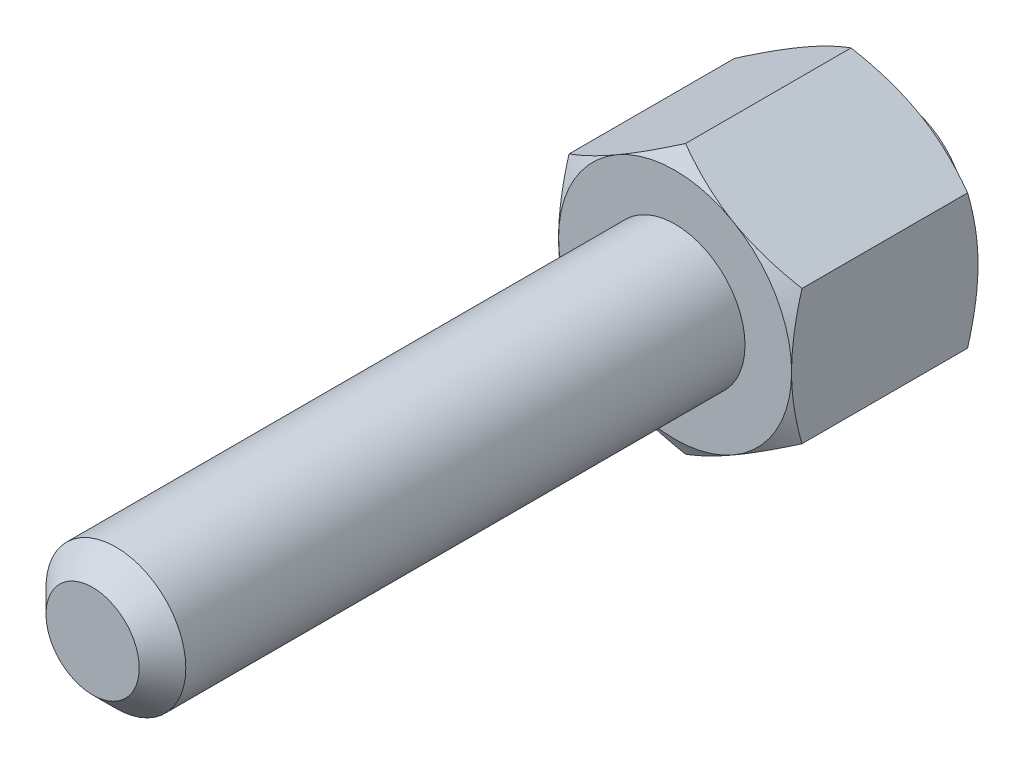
ISO-10303-21;
HEADER;
FILE_DESCRIPTION(('STEP AP214'),'2;1');
FILE_NAME('part.step','',(''),(''),'','','');
FILE_SCHEMA(('AUTOMOTIVE_DESIGN { 1 0 10303 214 1 1 1 1 }'));
ENDSEC;
DATA;
#1=APPLICATION_CONTEXT('core data for automotive mechanical design processes');
#2=APPLICATION_PROTOCOL_DEFINITION('international standard','automotive_design',2000,#1);
#3=PRODUCT_CONTEXT('',#1,'mechanical');
#4=PRODUCT('Part','Part','',(#3));
#5=PRODUCT_RELATED_PRODUCT_CATEGORY('part','',(#4));
#6=PRODUCT_DEFINITION_FORMATION('','',#4);
#7=PRODUCT_DEFINITION_CONTEXT('part definition',#1,'design');
#8=PRODUCT_DEFINITION('design','',#6,#7);
#9=PRODUCT_DEFINITION_SHAPE('','',#8);
#10=(LENGTH_UNIT() NAMED_UNIT(*) SI_UNIT(.MILLI.,.METRE.));
#11=(NAMED_UNIT(*) PLANE_ANGLE_UNIT() SI_UNIT($,.RADIAN.));
#12=(NAMED_UNIT(*) SI_UNIT($,.STERADIAN.) SOLID_ANGLE_UNIT());
#13=UNCERTAINTY_MEASURE_WITH_UNIT(LENGTH_MEASURE(1.E-05),#10,'distance_accuracy_value','');
#14=(GEOMETRIC_REPRESENTATION_CONTEXT(3) GLOBAL_UNCERTAINTY_ASSIGNED_CONTEXT((#13)) GLOBAL_UNIT_ASSIGNED_CONTEXT((#10,
#11,#12)) REPRESENTATION_CONTEXT('',''));
#15=CARTESIAN_POINT('',(0.,0.,0.));
#16=DIRECTION('',(0.,0.,1.));
#17=DIRECTION('',(1.,0.,0.));
#18=AXIS2_PLACEMENT_3D('',#15,#16,#17);
#19=CARTESIAN_POINT('',(0.,-5.77350269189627,11.5));
#20=DIRECTION('',(-0.500000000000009,0.866025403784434,0.));
#21=DIRECTION('',(0.866025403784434,0.500000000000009,0.));
#22=AXIS2_PLACEMENT_3D('',#19,#20,#21);
#23=PLANE('',#22);
#24=CARTESIAN_POINT('',(5.0002,-2.88663587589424,1.94664865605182));
#25=CARTESIAN_POINT('',(4.78046540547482,-3.01349970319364,1.87338656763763));
#26=CARTESIAN_POINT('',(4.55885141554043,-3.14144859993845,1.80675132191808));
#27=CARTESIAN_POINT('',(4.1117860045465,-3.39956193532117,1.6904389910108));
#28=CARTESIAN_POINT('',(3.88632664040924,-3.52973095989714,1.64080304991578));
#29=CARTESIAN_POINT('',(3.43816769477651,-3.78847564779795,1.56355102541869));
#30=CARTESIAN_POINT('',(3.21553790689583,-3.91701101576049,1.53542037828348));
#31=CARTESIAN_POINT('',(2.88081009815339,-4.1102662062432,1.51019492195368));
#32=CARTESIAN_POINT('',(2.76915780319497,-4.17472868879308,1.50461345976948));
#33=CARTESIAN_POINT('',(2.54575002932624,-4.30371322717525,1.49920221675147));
#34=CARTESIAN_POINT('',(2.43399455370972,-4.36823528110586,1.4993722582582));
#35=CARTESIAN_POINT('',(2.12781576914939,-4.54500768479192,1.50775363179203));
#36=CARTESIAN_POINT('',(1.93349391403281,-4.65719946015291,1.52182977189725));
#37=CARTESIAN_POINT('',(1.54613989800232,-4.88083840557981,1.56646525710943));
#38=CARTESIAN_POINT('',(1.35310909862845,-4.9922847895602,1.59703986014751));
#39=CARTESIAN_POINT('',(0.964974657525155,-5.21637431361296,1.67346849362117));
#40=CARTESIAN_POINT('',(0.76992000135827,-5.3289891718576,1.71964637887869));
#41=CARTESIAN_POINT('',(0.38271965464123,-5.55253939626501,1.82445179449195));
#42=CARTESIAN_POINT('',(0.190569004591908,-5.66347762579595,1.88305470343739));
#43=CARTESIAN_POINT('',(-0.000200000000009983,-5.77361816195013,1.94664865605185));
#44=B_SPLINE_CURVE_WITH_KNOTS('',3,(#24,#25,#26,#27,#28,#29,#30,#31,#32,#33,#34,#35,#36,#37,#38,
#39,#40,#41,#42,#43),.UNSPECIFIED.,.F.,.F.,(4,2,2,2,2,2,2,2,2,4),(0.,0.792555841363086,
1.58701660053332,2.36181537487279,2.74884076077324,3.13585419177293,3.80962362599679,
4.48401723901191,5.17336882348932,5.8613669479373),.UNSPECIFIED.);
#45=CARTESIAN_POINT('',(5.,-2.88675134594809,1.94658198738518));
#46=VERTEX_POINT('',#45);
#47=CARTESIAN_POINT('',(2.5,-4.3301270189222,1.5));
#48=VERTEX_POINT('',#47);
#49=EDGE_CURVE('E137',#46,#48,#44,.T.);
#50=ORIENTED_EDGE('',*,*,#49,.F.);
#51=DIRECTION('',(0.,0.,-1.));
#52=VECTOR('',#51,1.);
#53=CARTESIAN_POINT('',(5.,-2.88675134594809,11.5));
#54=LINE('',#53,#52);
#55=CARTESIAN_POINT('',(5.,-2.88675134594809,9.05341801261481));
#56=VERTEX_POINT('',#55);
#57=EDGE_CURVE('E299',#56,#46,#54,.T.);
#58=ORIENTED_EDGE('',*,*,#57,.F.);
#59=CARTESIAN_POINT('',(-0.00019999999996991,-5.77361816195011,9.05335134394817));
#60=CARTESIAN_POINT('',(0.219534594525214,-5.64675433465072,9.12661343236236));
#61=CARTESIAN_POINT('',(0.441148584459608,-5.5188054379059,9.1932486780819));
#62=CARTESIAN_POINT('',(0.888213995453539,-5.26069210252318,9.30956100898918));
#63=CARTESIAN_POINT('',(1.1136733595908,-5.13052307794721,9.35919695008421));
#64=CARTESIAN_POINT('',(1.56183230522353,-4.8717783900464,9.4364489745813));
#65=CARTESIAN_POINT('',(1.78446209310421,-4.74324302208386,9.46457962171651));
#66=CARTESIAN_POINT('',(2.11918990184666,-4.54998783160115,9.48980507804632));
#67=CARTESIAN_POINT('',(2.23084219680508,-4.48552534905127,9.49538654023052));
#68=CARTESIAN_POINT('',(2.45424997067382,-4.35654081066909,9.50079778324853));
#69=CARTESIAN_POINT('',(2.56600544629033,-4.29201875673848,9.5006277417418));
#70=CARTESIAN_POINT('',(2.87218423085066,-4.11524635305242,9.49224636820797));
#71=CARTESIAN_POINT('',(3.06650608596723,-4.00305457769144,9.47817022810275));
#72=CARTESIAN_POINT('',(3.45386010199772,-3.77941563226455,9.43353474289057));
#73=CARTESIAN_POINT('',(3.64689090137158,-3.66796924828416,9.4029601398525));
#74=CARTESIAN_POINT('',(4.03502534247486,-3.44387972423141,9.32653150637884));
#75=CARTESIAN_POINT('',(4.23007999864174,-3.33126486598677,9.28035362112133));
#76=CARTESIAN_POINT('',(4.61728034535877,-3.10771464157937,9.17554820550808));
#77=CARTESIAN_POINT('',(4.80943099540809,-2.99677641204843,9.11694529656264));
#78=CARTESIAN_POINT('',(5.0002,-2.88663587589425,9.05335134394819));
#79=B_SPLINE_CURVE_WITH_KNOTS('',3,(#59,#60,#61,#62,#63,#64,#65,#66,#67,#68,#69,#70,#71,#72,#73,
#74,#75,#76,#77,#78),.UNSPECIFIED.,.F.,.F.,(4,2,2,2,2,2,2,2,2,4),(0.,0.792555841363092,
1.58701660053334,2.36181537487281,2.74884076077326,3.13585419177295,3.8096236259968,
4.48401723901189,5.17336882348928,5.86136694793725),.UNSPECIFIED.);
#80=CARTESIAN_POINT('',(2.50000000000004,-4.33012701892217,9.5));
#81=VERTEX_POINT('',#80);
#82=EDGE_CURVE('E213',#81,#56,#79,.T.);
#83=ORIENTED_EDGE('',*,*,#82,.F.);
#84=CARTESIAN_POINT('',(0.,-5.77350269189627,9.0534180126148));
#85=VERTEX_POINT('',#84);
#86=EDGE_CURVE('E259',#85,#81,#79,.T.);
#87=ORIENTED_EDGE('',*,*,#86,.F.);
#88=DIRECTION('',(0.,0.,-1.));
#89=VECTOR('',#88,1.);
#90=CARTESIAN_POINT('',(0.,-5.77350269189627,11.5));
#91=LINE('',#90,#89);
#92=CARTESIAN_POINT('',(0.,-5.77350269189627,1.94658198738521));
#93=VERTEX_POINT('',#92);
#94=EDGE_CURVE('E294',#85,#93,#91,.T.);
#95=ORIENTED_EDGE('',*,*,#94,.T.);
#96=EDGE_CURVE('E37',#48,#93,#44,.T.);
#97=ORIENTED_EDGE('',*,*,#96,.F.);
#98=EDGE_LOOP('',(#50,#58,#83,#87,#95,#97));
#99=FACE_BOUND('',#98,.T.);
#100=ADVANCED_FACE('F14',(#99),#23,.F.);
#101=CARTESIAN_POINT('',(5.,-2.88675134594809,11.5));
#102=DIRECTION('',(-1.,0.,0.));
#103=DIRECTION('',(0.,0.,-1.));
#104=AXIS2_PLACEMENT_3D('',#101,#102,#103);
#105=PLANE('',#104);
#106=CARTESIAN_POINT('',(5.,-7.70744127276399,3.91748127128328));
#107=CARTESIAN_POINT('',(5.,-7.48944850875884,3.8119239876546));
#108=CARTESIAN_POINT('',(5.,-7.27095027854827,3.70739243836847));
#109=CARTESIAN_POINT('',(5.,-6.83267390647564,3.50095865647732));
#110=CARTESIAN_POINT('',(5.,-6.61289556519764,3.39905684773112));
#111=CARTESIAN_POINT('',(5.,-6.17063500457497,3.19793766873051));
#112=CARTESIAN_POINT('',(5.,-5.94814454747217,3.09873834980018));
#113=CARTESIAN_POINT('',(5.,-5.50137759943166,2.90446216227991));
#114=CARTESIAN_POINT('',(5.,-5.27710119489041,2.80938509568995));
#115=CARTESIAN_POINT('',(5.,-4.81934362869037,2.62154541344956));
#116=CARTESIAN_POINT('',(5.,-4.58579411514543,2.52894844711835));
#117=CARTESIAN_POINT('',(5.,-4.11594543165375,2.35087648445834));
#118=CARTESIAN_POINT('',(5.,-3.87964595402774,2.26540229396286));
#119=CARTESIAN_POINT('',(5.,-3.40437913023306,2.10385408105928));
#120=CARTESIAN_POINT('',(5.,-3.16541846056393,2.02776061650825));
#121=CARTESIAN_POINT('',(5.,-2.68406991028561,1.88744643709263));
#122=CARTESIAN_POINT('',(5.,-2.44168315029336,1.82322193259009));
#123=CARTESIAN_POINT('',(5.,-1.95468423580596,1.7100982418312));
#124=CARTESIAN_POINT('',(5.,-1.71009137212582,1.66111755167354));
#125=CARTESIAN_POINT('',(5.,-1.2179134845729,1.58128125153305));
#126=CARTESIAN_POINT('',(5.,-0.970328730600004,1.5504240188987));
#127=CARTESIAN_POINT('',(5.,-0.476617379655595,1.50970112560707));
#128=CARTESIAN_POINT('',(5.,-0.230513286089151,1.49956934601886));
#129=CARTESIAN_POINT('',(5.,0.26167501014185,1.50045868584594));
#130=CARTESIAN_POINT('',(5.,0.507759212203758,1.51148030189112));
#131=CARTESIAN_POINT('',(5.,0.926943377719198,1.54749890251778));
#132=CARTESIAN_POINT('',(5.,1.10049654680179,1.56751128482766));
#133=CARTESIAN_POINT('',(5.,1.44629389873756,1.61678599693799));
#134=CARTESIAN_POINT('',(5.,1.61853789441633,1.64604962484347));
#135=CARTESIAN_POINT('',(5.,2.13309893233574,1.74617515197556));
#136=CARTESIAN_POINT('',(5.,2.47304427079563,1.82935219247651));
#137=CARTESIAN_POINT('',(5.,2.98128183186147,1.97308911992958));
#138=CARTESIAN_POINT('',(5.,3.15222109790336,2.02481822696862));
#139=CARTESIAN_POINT('',(5.,3.49243829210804,2.1335258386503));
#140=CARTESIAN_POINT('',(5.,3.66171620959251,2.19050437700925));
#141=CARTESIAN_POINT('',(5.,3.99866665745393,2.30880682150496));
#142=CARTESIAN_POINT('',(5.,4.16633972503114,2.37012921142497));
#143=CARTESIAN_POINT('',(5.,4.50030514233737,2.4964102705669));
#144=CARTESIAN_POINT('',(5.,4.66659750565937,2.56136890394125));
#145=CARTESIAN_POINT('',(5.,5.04803367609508,2.71440889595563));
#146=CARTESIAN_POINT('',(5.,5.26275324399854,2.80354544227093));
#147=CARTESIAN_POINT('',(5.,5.69045278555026,2.9859093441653));
#148=CARTESIAN_POINT('',(5.,5.90343266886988,3.07913691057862));
#149=CARTESIAN_POINT('',(5.,6.32795935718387,3.26889080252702));
#150=CARTESIAN_POINT('',(5.,6.53950590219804,3.36541770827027));
#151=CARTESIAN_POINT('',(5.,6.96136313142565,3.56113912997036));
#152=CARTESIAN_POINT('',(5.,7.17167379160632,3.66033369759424));
#153=CARTESIAN_POINT('',(5.,7.80142682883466,3.96134775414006));
#154=CARTESIAN_POINT('',(5.,8.21931083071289,4.16642577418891));
#155=CARTESIAN_POINT('',(5.,9.05210217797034,4.5825381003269));
#156=CARTESIAN_POINT('',(5.,9.46700942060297,4.79357261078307));
#157=CARTESIAN_POINT('',(5.,10.0712479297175,5.10485123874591));
#158=CARTESIAN_POINT('',(5.,10.2614503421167,5.20340928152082));
#159=CARTESIAN_POINT('',(5.,10.6414400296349,5.40131443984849));
#160=CARTESIAN_POINT('',(5.,10.8312273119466,5.50066154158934));
#161=CARTESIAN_POINT('',(5.,11.4000634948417,5.799737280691));
#162=CARTESIAN_POINT('',(5.,11.7785724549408,6.00049297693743));
#163=CARTESIAN_POINT('',(5.,12.5336033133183,6.40364018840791));
#164=CARTESIAN_POINT('',(5.,12.9101277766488,6.6060269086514));
#165=CARTESIAN_POINT('',(5.,13.6622573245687,7.01245675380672));
#166=CARTESIAN_POINT('',(5.,14.0378624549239,7.21649979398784));
#167=CARTESIAN_POINT('',(5.,14.4131258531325,7.42116548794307));
#168=B_SPLINE_CURVE_WITH_KNOTS('',3,(#106,#107,#108,#109,#110,#111,#112,#113,#114,#115,#116,
#117,#118,#119,#120,#121,#122,#123,#124,#125,#126,#127,#128,#129,#130,#131,#132,#133,#134,#135,
#136,#137,#138,#139,#140,#141,#142,#143,#144,#145,#146,#147,#148,#149,#150,#151,#152,#153,#154,
#155,#156,#157,#158,#159,#160,#161,#162,#163,#164,#165,#166,#167),.UNSPECIFIED.,.F.,.F.,(4,2,2,
2,2,2,2,2,2,2,2,2,2,2,2,2,2,2,2,2,2,2,2,2,2,2,2,2,2,2,4),(0.,0.726623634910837,1.45336366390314,
2.18413973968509,2.91488067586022,3.66849919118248,4.42220285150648,5.17431717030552,
5.92619093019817,6.67397270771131,7.42168752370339,8.15973969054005,8.89780918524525,
9.42166361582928,9.9455915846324,10.9940498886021,11.5297908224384,12.0655351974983,
12.6010934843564,13.1366464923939,13.8340490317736,14.5314875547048,15.229049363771,
15.9266246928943,17.3230246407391,18.7194725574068,19.3621341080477,20.0047844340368,
21.2901332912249,22.5725406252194,23.8548827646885),.UNSPECIFIED.);
#169=CARTESIAN_POINT('',(5.,2.88675134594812,1.94658198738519));
#170=VERTEX_POINT('',#169);
#171=CARTESIAN_POINT('',(5.,0.,1.5));
#172=VERTEX_POINT('',#171);
#173=EDGE_CURVE('E390',#170,#172,#168,.F.);
#174=ORIENTED_EDGE('',*,*,#173,.F.);
#175=DIRECTION('',(0.,0.,-1.));
#176=VECTOR('',#175,1.);
#177=CARTESIAN_POINT('',(5.,2.88675134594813,11.5));
#178=LINE('',#177,#176);
#179=CARTESIAN_POINT('',(5.,2.88675134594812,9.05341801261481));
#180=VERTEX_POINT('',#179);
#181=EDGE_CURVE('E291',#180,#170,#178,.T.);
#182=ORIENTED_EDGE('',*,*,#181,.F.);
#183=CARTESIAN_POINT('',(5.,-7.74883329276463,7.06245429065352));
#184=CARTESIAN_POINT('',(5.,-7.53049946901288,7.16834431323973));
#185=CARTESIAN_POINT('',(5.,-7.31166387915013,7.27321749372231));
#186=CARTESIAN_POINT('',(5.,-6.8727223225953,7.4803581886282));
#187=CARTESIAN_POINT('',(5.,-6.65261616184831,7.58262529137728));
#188=CARTESIAN_POINT('',(5.,-6.20972996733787,7.78449751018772));
#189=CARTESIAN_POINT('',(5.,-5.98694189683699,7.88408505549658));
#190=CARTESIAN_POINT('',(5.,-5.53959195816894,8.07917770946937));
#191=CARTESIAN_POINT('',(5.,-5.31503017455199,8.17468301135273));
#192=CARTESIAN_POINT('',(5.,-4.85653860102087,8.36351388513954));
#193=CARTESIAN_POINT('',(5.,-4.62253924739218,8.45667147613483));
#194=CARTESIAN_POINT('',(5.,-4.15180084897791,8.63592319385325));
#195=CARTESIAN_POINT('',(5.,-3.9150614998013,8.72201652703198));
#196=CARTESIAN_POINT('',(5.,-3.43891142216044,8.88487567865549));
#197=CARTESIAN_POINT('',(5.,-3.19950723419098,8.96166042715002));
#198=CARTESIAN_POINT('',(5.,-2.71726462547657,9.1034348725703));
#199=CARTESIAN_POINT('',(5.,-2.47442731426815,9.16842829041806));
#200=CARTESIAN_POINT('',(5.,-1.98653288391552,9.28315054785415));
#201=CARTESIAN_POINT('',(5.,-1.74149561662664,9.33296225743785));
#202=CARTESIAN_POINT('',(5.,-1.24837916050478,9.41450383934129));
#203=CARTESIAN_POINT('',(5.,-1.00030025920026,9.44623540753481));
#204=CARTESIAN_POINT('',(5.,-0.505577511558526,9.48866997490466));
#205=CARTESIAN_POINT('',(5.,-0.25895739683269,9.49964283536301));
#206=CARTESIAN_POINT('',(5.,0.234332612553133,9.50033965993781));
#207=CARTESIAN_POINT('',(5.,0.481002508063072,9.49006322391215));
#208=CARTESIAN_POINT('',(5.,0.899937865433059,9.45529080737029));
#209=CARTESIAN_POINT('',(5.,1.07265207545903,9.43589361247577));
#210=CARTESIAN_POINT('',(5.,1.41680507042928,9.3878920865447));
#211=CARTESIAN_POINT('',(5.,1.58824367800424,9.35928649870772));
#212=CARTESIAN_POINT('',(5.,2.10042470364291,9.26116179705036));
#213=CARTESIAN_POINT('',(5.,2.43883828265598,9.17935298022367));
#214=CARTESIAN_POINT('',(5.,2.94483676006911,9.03763933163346));
#215=CARTESIAN_POINT('',(5.,3.11504848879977,8.98658079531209));
#216=CARTESIAN_POINT('',(5.,3.45381823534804,8.87919651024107));
#217=CARTESIAN_POINT('',(5.,3.62237624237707,8.8228707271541));
#218=CARTESIAN_POINT('',(5.,3.95789251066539,8.70585282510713));
#219=CARTESIAN_POINT('',(5.,4.12485128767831,8.64516217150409));
#220=CARTESIAN_POINT('',(5.,4.45738812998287,8.52012492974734));
#221=CARTESIAN_POINT('',(5.,4.62296621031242,8.45577838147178));
#222=CARTESIAN_POINT('',(5.,5.00898021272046,8.30164185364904));
#223=CARTESIAN_POINT('',(5.,5.22893065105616,8.21063840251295));
#224=CARTESIAN_POINT('',(5.,5.66699461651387,8.02430103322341));
#225=CARTESIAN_POINT('',(5.,5.88510803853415,7.92896686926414));
#226=CARTESIAN_POINT('',(5.,6.31982994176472,7.73482468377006));
#227=CARTESIAN_POINT('',(5.,6.53643812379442,7.63601599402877));
#228=CARTESIAN_POINT('',(5.,6.96835984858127,7.43560426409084));
#229=CARTESIAN_POINT('',(5.,7.18367336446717,7.33400116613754));
#230=CARTESIAN_POINT('',(5.,7.82840184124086,7.02560744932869));
#231=CARTESIAN_POINT('',(5.,8.25619086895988,6.81541977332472));
#232=CARTESIAN_POINT('',(5.,9.10868695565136,6.3888855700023));
#233=CARTESIAN_POINT('',(5.,9.53339390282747,6.17253882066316));
#234=CARTESIAN_POINT('',(5.,10.1513439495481,5.85370074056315));
#235=CARTESIAN_POINT('',(5.,10.3454851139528,5.75294487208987));
#236=CARTESIAN_POINT('',(5.,10.7333432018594,5.55062830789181));
#237=CARTESIAN_POINT('',(5.,10.9270601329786,5.44906762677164));
#238=CARTESIAN_POINT('',(5.,11.5076762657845,5.14333198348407));
#239=CARTESIAN_POINT('',(5.,11.8940250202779,4.93811158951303));
#240=CARTESIAN_POINT('',(5.,12.6646488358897,4.52604252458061));
#241=CARTESIAN_POINT('',(5.,13.048926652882,4.3191989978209));
#242=CARTESIAN_POINT('',(5.,13.8165498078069,3.90383718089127));
#243=CARTESIAN_POINT('',(5.,14.199895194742,3.6953189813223));
#244=CARTESIAN_POINT('',(5.,14.5828959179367,3.48617358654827));
#245=B_SPLINE_CURVE_WITH_KNOTS('',3,(#183,#184,#185,#186,#187,#188,#189,#190,#191,#192,#193,
#194,#195,#196,#197,#198,#199,#200,#201,#202,#203,#204,#205,#206,#207,#208,#209,#210,#211,#212,
#213,#214,#215,#216,#217,#218,#219,#220,#221,#222,#223,#224,#225,#226,#227,#228,#229,#230,#231,
#232,#233,#234,#235,#236,#237,#238,#239,#240,#241,#242,#243,#244),.UNSPECIFIED.,.F.,.F.,(4,2,2,
2,2,2,2,2,2,2,2,2,2,2,2,2,2,2,2,2,2,2,2,2,2,2,2,2,2,2,4),(0.,0.727979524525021,1.45607334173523,
2.18814015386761,2.92017227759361,3.67566755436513,4.43124758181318,5.18526431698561,
5.93904269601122,6.68862964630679,7.43814627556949,8.17785045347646,8.91756856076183,
9.4387156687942,9.95993393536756,11.002952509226,11.5360222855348,12.0690955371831,
12.6019906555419,13.1348799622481,13.8489176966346,14.5629960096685,15.2772124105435,
15.9914435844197,17.4212685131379,18.8511450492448,19.5073316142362,20.1635062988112,
21.475908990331,22.7851347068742,24.0942900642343),.UNSPECIFIED.);
#246=CARTESIAN_POINT('',(5.,0.,9.5));
#247=VERTEX_POINT('',#246);
#248=EDGE_CURVE('E222',#247,#180,#245,.T.);
#249=ORIENTED_EDGE('',*,*,#248,.F.);
#250=EDGE_CURVE('E340',#56,#247,#245,.T.);
#251=ORIENTED_EDGE('',*,*,#250,.F.);
#252=ORIENTED_EDGE('',*,*,#57,.T.);
#253=EDGE_CURVE('E188',#172,#46,#168,.F.);
#254=ORIENTED_EDGE('',*,*,#253,.F.);
#255=EDGE_LOOP('',(#174,#182,#249,#251,#252,#254));
#256=FACE_BOUND('',#255,.T.);
#257=ADVANCED_FACE('F198',(#256),#105,.F.);
#258=CARTESIAN_POINT('',(0.,5.77350269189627,11.5));
#259=DIRECTION('',(0.5,0.866025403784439,0.));
#260=DIRECTION('',(0.866025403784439,-0.5,0.));
#261=AXIS2_PLACEMENT_3D('',#258,#259,#260);
#262=PLANE('',#261);
#263=ORIENTED_EDGE('',*,*,#181,.T.);
#264=CARTESIAN_POINT('',(5.0002,2.88663587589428,1.94664865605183));
#265=CARTESIAN_POINT('',(4.78046540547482,3.01349970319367,1.87338656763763));
#266=CARTESIAN_POINT('',(4.55885141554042,3.14144859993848,1.80675132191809));
#267=CARTESIAN_POINT('',(4.11178600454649,3.3995619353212,1.69043899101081));
#268=CARTESIAN_POINT('',(3.88632664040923,3.52973095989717,1.64080304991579));
#269=CARTESIAN_POINT('',(3.43816769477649,3.78847564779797,1.5635510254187));
#270=CARTESIAN_POINT('',(3.21553790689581,3.91701101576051,1.53542037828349));
#271=CARTESIAN_POINT('',(2.88081009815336,4.11026620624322,1.51019492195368));
#272=CARTESIAN_POINT('',(2.76915780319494,4.1747286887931,1.50461345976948));
#273=CARTESIAN_POINT('',(2.54575002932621,4.30371322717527,1.49920221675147));
#274=CARTESIAN_POINT('',(2.43399455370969,4.36823528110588,1.4993722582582));
#275=CARTESIAN_POINT('',(2.12781576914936,4.54500768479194,1.50775363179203));
#276=CARTESIAN_POINT('',(1.93349391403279,4.65719946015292,1.52182977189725));
#277=CARTESIAN_POINT('',(1.54613989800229,4.88083840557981,1.56646525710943));
#278=CARTESIAN_POINT('',(1.35310909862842,4.9922847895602,1.59703986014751));
#279=CARTESIAN_POINT('',(0.96497465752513,5.21637431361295,1.67346849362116));
#280=CARTESIAN_POINT('',(0.769920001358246,5.32898917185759,1.71964637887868));
#281=CARTESIAN_POINT('',(0.382719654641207,5.55253939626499,1.82445179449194));
#282=CARTESIAN_POINT('',(0.190569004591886,5.66347762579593,1.88305470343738));
#283=CARTESIAN_POINT('',(-0.000200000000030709,5.77361816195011,1.94664865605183));
#284=B_SPLINE_CURVE_WITH_KNOTS('',3,(#264,#265,#266,#267,#268,#269,#270,#271,#272,#273,#274,
#275,#276,#277,#278,#279,#280,#281,#282,#283),.UNSPECIFIED.,.F.,.F.,(4,2,2,2,2,2,2,2,2,4),(0.,
0.792555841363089,1.58701660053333,2.3618153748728,2.74884076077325,3.13585419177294,
3.8096236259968,4.48401723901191,5.17336882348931,5.86136694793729),.UNSPECIFIED.);
#285=CARTESIAN_POINT('',(2.5,4.33012701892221,1.5));
#286=VERTEX_POINT('',#285);
#287=EDGE_CURVE('E138',#170,#286,#284,.T.);
#288=ORIENTED_EDGE('',*,*,#287,.T.);
#289=CARTESIAN_POINT('',(0.,5.77350269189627,1.94658198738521));
#290=VERTEX_POINT('',#289);
#291=EDGE_CURVE('E118',#286,#290,#284,.T.);
#292=ORIENTED_EDGE('',*,*,#291,.T.);
#293=DIRECTION('',(0.,0.,-1.));
#294=VECTOR('',#293,1.);
#295=CARTESIAN_POINT('',(0.,5.77350269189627,11.5));
#296=LINE('',#295,#294);
#297=CARTESIAN_POINT('',(0.,5.77350269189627,9.0534180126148));
#298=VERTEX_POINT('',#297);
#299=EDGE_CURVE('E136',#298,#290,#296,.T.);
#300=ORIENTED_EDGE('',*,*,#299,.F.);
#301=CARTESIAN_POINT('',(-0.000200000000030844,5.77361816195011,9.05335134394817));
#302=CARTESIAN_POINT('',(0.219534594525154,5.64675433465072,9.12661343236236));
#303=CARTESIAN_POINT('',(0.44114858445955,5.51880543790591,9.1932486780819));
#304=CARTESIAN_POINT('',(0.888213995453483,5.26069210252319,9.30956100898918));
#305=CARTESIAN_POINT('',(1.11367335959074,5.13052307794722,9.35919695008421));
#306=CARTESIAN_POINT('',(1.56183230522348,4.87177839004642,9.4364489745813));
#307=CARTESIAN_POINT('',(1.78446209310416,4.74324302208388,9.46457962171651));
#308=CARTESIAN_POINT('',(2.11918990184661,4.54998783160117,9.48980507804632));
#309=CARTESIAN_POINT('',(2.23084219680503,4.48552534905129,9.49538654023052));
#310=CARTESIAN_POINT('',(2.45424997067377,4.35654081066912,9.50079778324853));
#311=CARTESIAN_POINT('',(2.56600544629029,4.29201875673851,9.5006277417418));
#312=CARTESIAN_POINT('',(2.87218423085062,4.11524635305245,9.49224636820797));
#313=CARTESIAN_POINT('',(3.06650608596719,4.00305457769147,9.47817022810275));
#314=CARTESIAN_POINT('',(3.45386010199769,3.77941563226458,9.43353474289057));
#315=CARTESIAN_POINT('',(3.64689090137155,3.66796924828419,9.4029601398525));
#316=CARTESIAN_POINT('',(4.03502534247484,3.44387972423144,9.32653150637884));
#317=CARTESIAN_POINT('',(4.23007999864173,3.3312648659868,9.28035362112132));
#318=CARTESIAN_POINT('',(4.61728034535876,3.1077146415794,9.17554820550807));
#319=CARTESIAN_POINT('',(4.80943099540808,2.99677641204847,9.11694529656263));
#320=CARTESIAN_POINT('',(5.0002,2.88663587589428,9.05335134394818));
#321=B_SPLINE_CURVE_WITH_KNOTS('',3,(#301,#302,#303,#304,#305,#306,#307,#308,#309,#310,#311,
#312,#313,#314,#315,#316,#317,#318,#319,#320),.UNSPECIFIED.,.F.,.F.,(4,2,2,2,2,2,2,2,2,4),(0.,
0.792555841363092,1.58701660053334,2.36181537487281,2.74884076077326,3.13585419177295,
3.8096236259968,4.48401723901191,5.17336882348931,5.86136694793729),.UNSPECIFIED.);
#322=CARTESIAN_POINT('',(2.5,4.33012701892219,9.5));
#323=VERTEX_POINT('',#322);
#324=EDGE_CURVE('E204',#298,#323,#321,.T.);
#325=ORIENTED_EDGE('',*,*,#324,.T.);
#326=EDGE_CURVE('E215',#323,#180,#321,.T.);
#327=ORIENTED_EDGE('',*,*,#326,.T.);
#328=EDGE_LOOP('',(#263,#288,#292,#300,#325,#327));
#329=FACE_BOUND('',#328,.T.);
#330=ADVANCED_FACE('F195',(#329),#262,.T.);
#331=CARTESIAN_POINT('',(0.,5.77350269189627,11.5));
#332=DIRECTION('',(0.500000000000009,-0.866025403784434,0.));
#333=DIRECTION('',(-0.866025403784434,-0.500000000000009,0.));
#334=AXIS2_PLACEMENT_3D('',#331,#332,#333);
#335=PLANE('',#334);
#336=CARTESIAN_POINT('',(-5.0002,2.88663587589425,1.94664865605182));
#337=CARTESIAN_POINT('',(-4.78046540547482,3.01349970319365,1.87338656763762));
#338=CARTESIAN_POINT('',(-4.55885141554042,3.14144859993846,1.80675132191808));
#339=CARTESIAN_POINT('',(-4.11178600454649,3.39956193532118,1.6904389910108));
#340=CARTESIAN_POINT('',(-3.88632664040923,3.52973095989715,1.64080304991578));
#341=CARTESIAN_POINT('',(-3.4381676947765,3.78847564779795,1.56355102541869));
#342=CARTESIAN_POINT('',(-3.21553790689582,3.9170110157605,1.53542037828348));
#343=CARTESIAN_POINT('',(-2.88081009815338,4.1102662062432,1.51019492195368));
#344=CARTESIAN_POINT('',(-2.76915780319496,4.17472868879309,1.50461345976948));
#345=CARTESIAN_POINT('',(-2.54575002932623,4.30371322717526,1.49920221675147));
#346=CARTESIAN_POINT('',(-2.43399455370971,4.36823528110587,1.4993722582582));
#347=CARTESIAN_POINT('',(-2.12781576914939,4.54500768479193,1.50775363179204));
#348=CARTESIAN_POINT('',(-1.93349391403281,4.65719946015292,1.52182977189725));
#349=CARTESIAN_POINT('',(-1.54613989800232,4.88083840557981,1.56646525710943));
#350=CARTESIAN_POINT('',(-1.35310909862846,4.9922847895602,1.59703986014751));
#351=CARTESIAN_POINT('',(-0.964974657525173,5.21637431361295,1.67346849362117));
#352=CARTESIAN_POINT('',(-0.769920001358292,5.32898917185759,1.71964637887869));
#353=CARTESIAN_POINT('',(-0.382719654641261,5.55253939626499,1.82445179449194));
#354=CARTESIAN_POINT('',(-0.190569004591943,5.66347762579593,1.88305470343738));
#355=CARTESIAN_POINT('',(0.00019999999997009,5.77361816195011,1.94664865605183));
#356=B_SPLINE_CURVE_WITH_KNOTS('',3,(#336,#337,#338,#339,#340,#341,#342,#343,#344,#345,#346,
#347,#348,#349,#350,#351,#352,#353,#354,#355),.UNSPECIFIED.,.F.,.F.,(4,2,2,2,2,2,2,2,2,4),(0.,
0.792555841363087,1.58701660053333,2.3618153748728,2.74884076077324,3.13585419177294,
3.80962362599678,4.48401723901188,5.17336882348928,5.86136694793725),.UNSPECIFIED.);
#357=CARTESIAN_POINT('',(-5.,2.8867513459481,1.94658198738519));
#358=VERTEX_POINT('',#357);
#359=CARTESIAN_POINT('',(-2.5,4.3301270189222,1.5));
#360=VERTEX_POINT('',#359);
#361=EDGE_CURVE('E102',#358,#360,#356,.T.);
#362=ORIENTED_EDGE('',*,*,#361,.F.);
#363=DIRECTION('',(0.,0.,-1.));
#364=VECTOR('',#363,1.);
#365=CARTESIAN_POINT('',(-5.,2.8867513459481,11.5));
#366=LINE('',#365,#364);
#367=CARTESIAN_POINT('',(-5.,2.8867513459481,9.05341801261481));
#368=VERTEX_POINT('',#367);
#369=EDGE_CURVE('E284',#368,#358,#366,.T.);
#370=ORIENTED_EDGE('',*,*,#369,.F.);
#371=CARTESIAN_POINT('',(0.00019999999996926,5.77361816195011,9.05335134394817));
#372=CARTESIAN_POINT('',(-0.219534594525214,5.64675433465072,9.12661343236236));
#373=CARTESIAN_POINT('',(-0.441148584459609,5.5188054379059,9.1932486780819));
#374=CARTESIAN_POINT('',(-0.88821399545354,5.26069210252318,9.30956100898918));
#375=CARTESIAN_POINT('',(-1.1136733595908,5.13052307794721,9.35919695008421));
#376=CARTESIAN_POINT('',(-1.56183230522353,4.8717783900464,9.4364489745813));
#377=CARTESIAN_POINT('',(-1.78446209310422,4.74324302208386,9.46457962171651));
#378=CARTESIAN_POINT('',(-2.11918990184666,4.54998783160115,9.48980507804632));
#379=CARTESIAN_POINT('',(-2.23084219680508,4.48552534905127,9.49538654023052));
#380=CARTESIAN_POINT('',(-2.45424997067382,4.35654081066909,9.50079778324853));
#381=CARTESIAN_POINT('',(-2.56600544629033,4.29201875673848,9.5006277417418));
#382=CARTESIAN_POINT('',(-2.87218423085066,4.11524635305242,9.49224636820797));
#383=CARTESIAN_POINT('',(-3.06650608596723,4.00305457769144,9.47817022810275));
#384=CARTESIAN_POINT('',(-3.45386010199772,3.77941563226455,9.43353474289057));
#385=CARTESIAN_POINT('',(-3.64689090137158,3.66796924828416,9.4029601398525));
#386=CARTESIAN_POINT('',(-4.03502534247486,3.44387972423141,9.32653150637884));
#387=CARTESIAN_POINT('',(-4.23007999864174,3.33126486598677,9.28035362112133));
#388=CARTESIAN_POINT('',(-4.61728034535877,3.10771464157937,9.17554820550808));
#389=CARTESIAN_POINT('',(-4.80943099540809,2.99677641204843,9.11694529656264));
#390=CARTESIAN_POINT('',(-5.0002,2.88663587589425,9.05335134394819));
#391=B_SPLINE_CURVE_WITH_KNOTS('',3,(#371,#372,#373,#374,#375,#376,#377,#378,#379,#380,#381,
#382,#383,#384,#385,#386,#387,#388,#389,#390),.UNSPECIFIED.,.F.,.F.,(4,2,2,2,2,2,2,2,2,4),(0.,
0.792555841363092,1.58701660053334,2.36181537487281,2.74884076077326,3.13585419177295,
3.80962362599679,4.48401723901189,5.17336882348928,5.86136694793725),.UNSPECIFIED.);
#392=CARTESIAN_POINT('',(-2.50000000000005,4.33012701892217,9.5));
#393=VERTEX_POINT('',#392);
#394=EDGE_CURVE('E216',#393,#368,#391,.T.);
#395=ORIENTED_EDGE('',*,*,#394,.F.);
#396=EDGE_CURVE('E214',#298,#393,#391,.T.);
#397=ORIENTED_EDGE('',*,*,#396,.F.);
#398=ORIENTED_EDGE('',*,*,#299,.T.);
#399=EDGE_CURVE('E112',#360,#290,#356,.T.);
#400=ORIENTED_EDGE('',*,*,#399,.F.);
#401=EDGE_LOOP('',(#362,#370,#395,#397,#398,#400));
#402=FACE_BOUND('',#401,.T.);
#403=ADVANCED_FACE('F133',(#402),#335,.F.);
#404=CARTESIAN_POINT('',(-5.,-2.88675134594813,11.5));
#405=DIRECTION('',(-1.,0.,0.));
#406=DIRECTION('',(0.,0.,-1.));
#407=AXIS2_PLACEMENT_3D('',#404,#405,#406);
#408=PLANE('',#407);
#409=ORIENTED_EDGE('',*,*,#369,.T.);
#410=CARTESIAN_POINT('',(-5.,-7.70744127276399,3.91748127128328));
#411=CARTESIAN_POINT('',(-5.,-7.48944850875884,3.8119239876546));
#412=CARTESIAN_POINT('',(-5.,-7.27095027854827,3.70739243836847));
#413=CARTESIAN_POINT('',(-5.,-6.83267390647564,3.50095865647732));
#414=CARTESIAN_POINT('',(-5.,-6.61289556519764,3.39905684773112));
#415=CARTESIAN_POINT('',(-5.,-6.17063500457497,3.19793766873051));
#416=CARTESIAN_POINT('',(-5.,-5.94814454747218,3.09873834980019));
#417=CARTESIAN_POINT('',(-5.,-5.50137759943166,2.90446216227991));
#418=CARTESIAN_POINT('',(-5.,-5.27710119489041,2.80938509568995));
#419=CARTESIAN_POINT('',(-5.,-4.81934362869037,2.62154541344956));
#420=CARTESIAN_POINT('',(-5.,-4.58579411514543,2.52894844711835));
#421=CARTESIAN_POINT('',(-5.,-4.11594543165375,2.35087648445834));
#422=CARTESIAN_POINT('',(-5.,-3.87964595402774,2.26540229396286));
#423=CARTESIAN_POINT('',(-5.,-3.40437913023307,2.10385408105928));
#424=CARTESIAN_POINT('',(-5.,-3.16541846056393,2.02776061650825));
#425=CARTESIAN_POINT('',(-5.,-2.68406991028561,1.88744643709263));
#426=CARTESIAN_POINT('',(-5.,-2.44168315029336,1.82322193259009));
#427=CARTESIAN_POINT('',(-5.,-1.95468423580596,1.7100982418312));
#428=CARTESIAN_POINT('',(-5.,-1.71009137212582,1.66111755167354));
#429=CARTESIAN_POINT('',(-5.,-1.2179134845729,1.58128125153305));
#430=CARTESIAN_POINT('',(-5.,-0.970328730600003,1.5504240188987));
#431=CARTESIAN_POINT('',(-5.,-0.476617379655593,1.50970112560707));
#432=CARTESIAN_POINT('',(-5.,-0.23051328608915,1.49956934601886));
#433=CARTESIAN_POINT('',(-5.,0.261675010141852,1.50045868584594));
#434=CARTESIAN_POINT('',(-5.,0.50775921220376,1.51148030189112));
#435=CARTESIAN_POINT('',(-5.,0.926943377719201,1.54749890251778));
#436=CARTESIAN_POINT('',(-5.,1.10049654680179,1.56751128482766));
#437=CARTESIAN_POINT('',(-5.,1.44629389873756,1.61678599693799));
#438=CARTESIAN_POINT('',(-5.,1.61853789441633,1.64604962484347));
#439=CARTESIAN_POINT('',(-5.,2.13309893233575,1.74617515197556));
#440=CARTESIAN_POINT('',(-5.,2.47304427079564,1.82935219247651));
#441=CARTESIAN_POINT('',(-5.,2.98128183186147,1.97308911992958));
#442=CARTESIAN_POINT('',(-5.,3.15222109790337,2.02481822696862));
#443=CARTESIAN_POINT('',(-5.,3.49243829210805,2.1335258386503));
#444=CARTESIAN_POINT('',(-5.,3.66171620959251,2.19050437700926));
#445=CARTESIAN_POINT('',(-5.,3.99866665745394,2.30880682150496));
#446=CARTESIAN_POINT('',(-5.,4.16633972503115,2.37012921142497));
#447=CARTESIAN_POINT('',(-5.,4.50030514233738,2.4964102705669));
#448=CARTESIAN_POINT('',(-5.,4.66659750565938,2.56136890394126));
#449=CARTESIAN_POINT('',(-5.,5.04803367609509,2.71440889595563));
#450=CARTESIAN_POINT('',(-5.,5.26275324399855,2.80354544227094));
#451=CARTESIAN_POINT('',(-5.,5.69045278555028,2.9859093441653));
#452=CARTESIAN_POINT('',(-5.,5.90343266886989,3.07913691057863));
#453=CARTESIAN_POINT('',(-5.,6.32795935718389,3.26889080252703));
#454=CARTESIAN_POINT('',(-5.,6.53950590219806,3.36541770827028));
#455=CARTESIAN_POINT('',(-5.,6.96136313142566,3.56113912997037));
#456=CARTESIAN_POINT('',(-5.,7.17167379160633,3.66033369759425));
#457=CARTESIAN_POINT('',(-5.,7.80142682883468,3.96134775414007));
#458=CARTESIAN_POINT('',(-5.,8.21931083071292,4.16642577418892));
#459=CARTESIAN_POINT('',(-5.,9.05210217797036,4.58253810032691));
#460=CARTESIAN_POINT('',(-5.,9.46700942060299,4.79357261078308));
#461=CARTESIAN_POINT('',(-5.,10.0712479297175,5.10485123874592));
#462=CARTESIAN_POINT('',(-5.,10.2614503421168,5.20340928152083));
#463=CARTESIAN_POINT('',(-5.,10.641440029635,5.4013144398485));
#464=CARTESIAN_POINT('',(-5.,10.8312273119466,5.50066154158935));
#465=CARTESIAN_POINT('',(-5.,11.4000634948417,5.79973728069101));
#466=CARTESIAN_POINT('',(-5.,11.7785724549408,6.00049297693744));
#467=CARTESIAN_POINT('',(-5.,12.5336033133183,6.40364018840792));
#468=CARTESIAN_POINT('',(-5.,12.9101277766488,6.60602690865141));
#469=CARTESIAN_POINT('',(-5.,13.6622573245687,7.01245675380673));
#470=CARTESIAN_POINT('',(-5.,14.0378624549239,7.21649979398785));
#471=CARTESIAN_POINT('',(-5.,14.4131258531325,7.42116548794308));
#472=B_SPLINE_CURVE_WITH_KNOTS('',3,(#410,#411,#412,#413,#414,#415,#416,#417,#418,#419,#420,
#421,#422,#423,#424,#425,#426,#427,#428,#429,#430,#431,#432,#433,#434,#435,#436,#437,#438,#439,
#440,#441,#442,#443,#444,#445,#446,#447,#448,#449,#450,#451,#452,#453,#454,#455,#456,#457,#458,
#459,#460,#461,#462,#463,#464,#465,#466,#467,#468,#469,#470,#471),.UNSPECIFIED.,.F.,.F.,(4,2,2,
2,2,2,2,2,2,2,2,2,2,2,2,2,2,2,2,2,2,2,2,2,2,2,2,2,2,2,4),(0.,0.726623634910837,1.45336366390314,
2.18413973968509,2.91488067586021,3.66849919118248,4.42220285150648,5.17431717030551,
5.92619093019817,6.67397270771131,7.42168752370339,8.15973969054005,8.89780918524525,
9.42166361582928,9.9455915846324,10.9940498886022,11.5297908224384,12.0655351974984,
12.6010934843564,13.1366464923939,13.8340490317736,14.5314875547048,15.229049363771,
15.9266246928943,17.3230246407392,18.7194725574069,19.3621341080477,20.0047844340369,
21.290133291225,22.5725406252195,23.8548827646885),.UNSPECIFIED.);
#473=CARTESIAN_POINT('',(-5.,0.,1.5));
#474=VERTEX_POINT('',#473);
#475=EDGE_CURVE('E106',#358,#474,#472,.F.);
#476=ORIENTED_EDGE('',*,*,#475,.T.);
#477=CARTESIAN_POINT('',(-5.,-2.88675134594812,1.94658198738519));
#478=VERTEX_POINT('',#477);
#479=EDGE_CURVE('E148',#474,#478,#472,.F.);
#480=ORIENTED_EDGE('',*,*,#479,.T.);
#481=DIRECTION('',(0.,0.,-1.));
#482=VECTOR('',#481,1.);
#483=CARTESIAN_POINT('',(-5.,-2.88675134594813,11.5));
#484=LINE('',#483,#482);
#485=CARTESIAN_POINT('',(-5.,-2.88675134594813,9.0534180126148));
#486=VERTEX_POINT('',#485);
#487=EDGE_CURVE('E289',#486,#478,#484,.T.);
#488=ORIENTED_EDGE('',*,*,#487,.F.);
#489=CARTESIAN_POINT('',(-5.,-7.74883329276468,7.0624542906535));
#490=CARTESIAN_POINT('',(-5.,-7.53049946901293,7.1683443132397));
#491=CARTESIAN_POINT('',(-5.,-7.31166387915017,7.27321749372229));
#492=CARTESIAN_POINT('',(-5.,-6.87272232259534,7.48035818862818));
#493=CARTESIAN_POINT('',(-5.,-6.65261616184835,7.58262529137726));
#494=CARTESIAN_POINT('',(-5.,-6.20972996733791,7.7844975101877));
#495=CARTESIAN_POINT('',(-5.,-5.98694189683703,7.88408505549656));
#496=CARTESIAN_POINT('',(-5.,-5.53959195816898,8.07917770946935));
#497=CARTESIAN_POINT('',(-5.,-5.31503017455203,8.17468301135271));
#498=CARTESIAN_POINT('',(-5.,-4.85653860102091,8.36351388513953));
#499=CARTESIAN_POINT('',(-5.,-4.62253924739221,8.45667147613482));
#500=CARTESIAN_POINT('',(-5.,-4.15180084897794,8.63592319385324));
#501=CARTESIAN_POINT('',(-5.,-3.91506149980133,8.72201652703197));
#502=CARTESIAN_POINT('',(-5.,-3.43891142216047,8.88487567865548));
#503=CARTESIAN_POINT('',(-5.,-3.19950723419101,8.96166042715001));
#504=CARTESIAN_POINT('',(-5.,-2.7172646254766,9.1034348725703));
#505=CARTESIAN_POINT('',(-5.,-2.47442731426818,9.16842829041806));
#506=CARTESIAN_POINT('',(-5.,-1.98653288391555,9.28315054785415));
#507=CARTESIAN_POINT('',(-5.,-1.74149561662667,9.33296225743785));
#508=CARTESIAN_POINT('',(-5.,-1.24837916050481,9.41450383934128));
#509=CARTESIAN_POINT('',(-5.,-1.00030025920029,9.44623540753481));
#510=CARTESIAN_POINT('',(-5.,-0.505577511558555,9.48866997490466));
#511=CARTESIAN_POINT('',(-5.,-0.258957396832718,9.49964283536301));
#512=CARTESIAN_POINT('',(-5.,0.234332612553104,9.50033965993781));
#513=CARTESIAN_POINT('',(-5.,0.481002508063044,9.49006322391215));
#514=CARTESIAN_POINT('',(-5.,0.899937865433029,9.45529080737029));
#515=CARTESIAN_POINT('',(-5.,1.072652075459,9.43589361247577));
#516=CARTESIAN_POINT('',(-5.,1.41680507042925,9.3878920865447));
#517=CARTESIAN_POINT('',(-5.,1.58824367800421,9.35928649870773));
#518=CARTESIAN_POINT('',(-5.,2.10042470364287,9.26116179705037));
#519=CARTESIAN_POINT('',(-5.,2.43883828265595,9.17935298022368));
#520=CARTESIAN_POINT('',(-5.,2.94483676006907,9.03763933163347));
#521=CARTESIAN_POINT('',(-5.,3.11504848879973,8.9865807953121));
#522=CARTESIAN_POINT('',(-5.,3.453818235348,8.87919651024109));
#523=CARTESIAN_POINT('',(-5.,3.62237624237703,8.82287072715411));
#524=CARTESIAN_POINT('',(-5.,3.95789251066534,8.70585282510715));
#525=CARTESIAN_POINT('',(-5.,4.12485128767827,8.64516217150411));
#526=CARTESIAN_POINT('',(-5.,4.45738812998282,8.52012492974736));
#527=CARTESIAN_POINT('',(-5.,4.62296621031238,8.4557783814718));
#528=CARTESIAN_POINT('',(-5.,5.00898021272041,8.30164185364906));
#529=CARTESIAN_POINT('',(-5.,5.22893065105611,8.21063840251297));
#530=CARTESIAN_POINT('',(-5.,5.66699461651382,8.02430103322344));
#531=CARTESIAN_POINT('',(-5.,5.8851080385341,7.92896686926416));
#532=CARTESIAN_POINT('',(-5.,6.31982994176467,7.73482468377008));
#533=CARTESIAN_POINT('',(-5.,6.53643812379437,7.63601599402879));
#534=CARTESIAN_POINT('',(-5.,6.96835984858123,7.43560426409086));
#535=CARTESIAN_POINT('',(-5.,7.18367336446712,7.33400116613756));
#536=CARTESIAN_POINT('',(-5.,7.82840184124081,7.02560744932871));
#537=CARTESIAN_POINT('',(-5.,8.25619086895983,6.81541977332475));
#538=CARTESIAN_POINT('',(-5.,9.1086869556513,6.38888557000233));
#539=CARTESIAN_POINT('',(-5.,9.53339390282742,6.17253882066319));
#540=CARTESIAN_POINT('',(-5.,10.1513439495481,5.85370074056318));
#541=CARTESIAN_POINT('',(-5.,10.3454851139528,5.7529448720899));
#542=CARTESIAN_POINT('',(-5.,10.7333432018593,5.55062830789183));
#543=CARTESIAN_POINT('',(-5.,10.9270601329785,5.44906762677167));
#544=CARTESIAN_POINT('',(-5.,11.5076762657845,5.1433319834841));
#545=CARTESIAN_POINT('',(-5.,11.8940250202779,4.93811158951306));
#546=CARTESIAN_POINT('',(-5.,12.6646488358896,4.52604252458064));
#547=CARTESIAN_POINT('',(-5.,13.048926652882,4.31919899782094));
#548=CARTESIAN_POINT('',(-5.,13.8165498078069,3.9038371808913));
#549=CARTESIAN_POINT('',(-5.,14.199895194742,3.69531898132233));
#550=CARTESIAN_POINT('',(-5.,14.5828959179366,3.48617358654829));
#551=B_SPLINE_CURVE_WITH_KNOTS('',3,(#489,#490,#491,#492,#493,#494,#495,#496,#497,#498,#499,
#500,#501,#502,#503,#504,#505,#506,#507,#508,#509,#510,#511,#512,#513,#514,#515,#516,#517,#518,
#519,#520,#521,#522,#523,#524,#525,#526,#527,#528,#529,#530,#531,#532,#533,#534,#535,#536,#537,
#538,#539,#540,#541,#542,#543,#544,#545,#546,#547,#548,#549,#550),.UNSPECIFIED.,.F.,.F.,(4,2,2,
2,2,2,2,2,2,2,2,2,2,2,2,2,2,2,2,2,2,2,2,2,2,2,2,2,2,2,4),(0.,0.727979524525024,1.45607334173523,
2.18814015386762,2.92017227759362,3.67566755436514,4.4312475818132,5.18526431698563,
5.93904269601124,6.68862964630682,7.43814627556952,8.17785045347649,8.91756856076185,
9.43871566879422,9.95993393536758,11.002952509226,11.5360222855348,12.0690955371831,
12.601990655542,13.1348799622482,13.8489176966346,14.5629960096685,15.2772124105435,
15.9914435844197,17.4212685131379,18.8511450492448,19.5073316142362,20.1635062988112,
21.475908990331,22.7851347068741,24.0942900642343),.UNSPECIFIED.);
#552=CARTESIAN_POINT('',(-5.,0.,9.5));
#553=VERTEX_POINT('',#552);
#554=EDGE_CURVE('E252',#486,#553,#551,.T.);
#555=ORIENTED_EDGE('',*,*,#554,.T.);
#556=EDGE_CURVE('E265',#553,#368,#551,.T.);
#557=ORIENTED_EDGE('',*,*,#556,.T.);
#558=EDGE_LOOP('',(#409,#476,#480,#488,#555,#557));
#559=FACE_BOUND('',#558,.T.);
#560=ADVANCED_FACE('F272',(#559),#408,.T.);
#561=CARTESIAN_POINT('',(0.,-5.77350269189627,11.5));
#562=DIRECTION('',(-0.5,-0.866025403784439,0.));
#563=DIRECTION('',(-0.866025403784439,0.5,0.));
#564=AXIS2_PLACEMENT_3D('',#561,#562,#563);
#565=PLANE('',#564);
#566=ORIENTED_EDGE('',*,*,#487,.T.);
#567=CARTESIAN_POINT('',(-5.0002,-2.88663587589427,1.94664865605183));
#568=CARTESIAN_POINT('',(-4.78046540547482,-3.01349970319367,1.87338656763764));
#569=CARTESIAN_POINT('',(-4.55885141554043,-3.14144859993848,1.80675132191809));
#570=CARTESIAN_POINT('',(-4.1117860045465,-3.3995619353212,1.69043899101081));
#571=CARTESIAN_POINT('',(-3.88632664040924,-3.52973095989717,1.64080304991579));
#572=CARTESIAN_POINT('',(-3.4381676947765,-3.78847564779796,1.5635510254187));
#573=CARTESIAN_POINT('',(-3.21553790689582,-3.9170110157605,1.53542037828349));
#574=CARTESIAN_POINT('',(-2.88081009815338,-4.11026620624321,1.51019492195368));
#575=CARTESIAN_POINT('',(-2.76915780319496,-4.17472868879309,1.50461345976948));
#576=CARTESIAN_POINT('',(-2.54575002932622,-4.30371322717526,1.49920221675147));
#577=CARTESIAN_POINT('',(-2.43399455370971,-4.36823528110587,1.4993722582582));
#578=CARTESIAN_POINT('',(-2.12781576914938,-4.54500768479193,1.50775363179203));
#579=CARTESIAN_POINT('',(-1.9334939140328,-4.65719946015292,1.52182977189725));
#580=CARTESIAN_POINT('',(-1.5461398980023,-4.8808384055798,1.56646525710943));
#581=CARTESIAN_POINT('',(-1.35310909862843,-4.9922847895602,1.59703986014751));
#582=CARTESIAN_POINT('',(-0.964974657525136,-5.21637431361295,1.67346849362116));
#583=CARTESIAN_POINT('',(-0.76992000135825,-5.32898917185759,1.71964637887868));
#584=CARTESIAN_POINT('',(-0.382719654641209,-5.55253939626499,1.82445179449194));
#585=CARTESIAN_POINT('',(-0.190569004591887,-5.66347762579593,1.88305470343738));
#586=CARTESIAN_POINT('',(0.00020000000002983,-5.77361816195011,1.94664865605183));
#587=B_SPLINE_CURVE_WITH_KNOTS('',3,(#567,#568,#569,#570,#571,#572,#573,#574,#575,#576,#577,
#578,#579,#580,#581,#582,#583,#584,#585,#586),.UNSPECIFIED.,.F.,.F.,(4,2,2,2,2,2,2,2,2,4),(0.,
0.792555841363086,1.58701660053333,2.36181537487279,2.74884076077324,3.13585419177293,
3.80962362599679,4.4840172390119,5.17336882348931,5.86136694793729),.UNSPECIFIED.);
#588=CARTESIAN_POINT('',(-2.5,-4.33012701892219,1.5));
#589=VERTEX_POINT('',#588);
#590=EDGE_CURVE('E368',#478,#589,#587,.T.);
#591=ORIENTED_EDGE('',*,*,#590,.T.);
#592=EDGE_CURVE('E130',#589,#93,#587,.T.);
#593=ORIENTED_EDGE('',*,*,#592,.T.);
#594=ORIENTED_EDGE('',*,*,#94,.F.);
#595=CARTESIAN_POINT('',(0.000200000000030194,-5.77361816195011,9.05335134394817));
#596=CARTESIAN_POINT('',(-0.219534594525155,-5.64675433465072,9.12661343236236));
#597=CARTESIAN_POINT('',(-0.441148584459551,-5.51880543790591,9.1932486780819));
#598=CARTESIAN_POINT('',(-0.888213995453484,-5.26069210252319,9.30956100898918));
#599=CARTESIAN_POINT('',(-1.11367335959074,-5.13052307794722,9.35919695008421));
#600=CARTESIAN_POINT('',(-1.56183230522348,-4.87177839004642,9.4364489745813));
#601=CARTESIAN_POINT('',(-1.78446209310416,-4.74324302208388,9.46457962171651));
#602=CARTESIAN_POINT('',(-2.11918990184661,-4.54998783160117,9.48980507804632));
#603=CARTESIAN_POINT('',(-2.23084219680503,-4.48552534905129,9.49538654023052));
#604=CARTESIAN_POINT('',(-2.45424997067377,-4.35654081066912,9.50079778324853));
#605=CARTESIAN_POINT('',(-2.56600544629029,-4.29201875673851,9.5006277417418));
#606=CARTESIAN_POINT('',(-2.87218423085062,-4.11524635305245,9.49224636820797));
#607=CARTESIAN_POINT('',(-3.06650608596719,-4.00305457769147,9.47817022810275));
#608=CARTESIAN_POINT('',(-3.45386010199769,-3.77941563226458,9.43353474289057));
#609=CARTESIAN_POINT('',(-3.64689090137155,-3.66796924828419,9.4029601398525));
#610=CARTESIAN_POINT('',(-4.03502534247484,-3.44387972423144,9.32653150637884));
#611=CARTESIAN_POINT('',(-4.23007999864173,-3.3312648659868,9.28035362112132));
#612=CARTESIAN_POINT('',(-4.61728034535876,-3.1077146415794,9.17554820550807));
#613=CARTESIAN_POINT('',(-4.80943099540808,-2.99677641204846,9.11694529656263));
#614=CARTESIAN_POINT('',(-5.0002,-2.88663587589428,9.05335134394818));
#615=B_SPLINE_CURVE_WITH_KNOTS('',3,(#595,#596,#597,#598,#599,#600,#601,#602,#603,#604,#605,
#606,#607,#608,#609,#610,#611,#612,#613,#614),.UNSPECIFIED.,.F.,.F.,(4,2,2,2,2,2,2,2,2,4),(0.,
0.792555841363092,1.58701660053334,2.36181537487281,2.74884076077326,3.13585419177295,
3.8096236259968,4.48401723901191,5.17336882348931,5.86136694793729),.UNSPECIFIED.);
#616=CARTESIAN_POINT('',(-2.5,-4.33012701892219,9.5));
#617=VERTEX_POINT('',#616);
#618=EDGE_CURVE('E306',#85,#617,#615,.T.);
#619=ORIENTED_EDGE('',*,*,#618,.T.);
#620=EDGE_CURVE('E242',#617,#486,#615,.T.);
#621=ORIENTED_EDGE('',*,*,#620,.T.);
#622=EDGE_LOOP('',(#566,#591,#593,#594,#619,#621));
#623=FACE_BOUND('',#622,.T.);
#624=ADVANCED_FACE('F233',(#623),#565,.T.);
#625=CARTESIAN_POINT('',(0.,0.,9.5));
#626=DIRECTION('',(0.,0.,-1.));
#627=DIRECTION('',(-1.,0.,0.));
#628=AXIS2_PLACEMENT_3D('',#625,#626,#627);
#629=CONICAL_SURFACE('',#628,5.,1.0471975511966);
#630=ORIENTED_EDGE('',*,*,#620,.F.);
#631=CARTESIAN_POINT('',(0.,0.,9.5));
#632=DIRECTION('',(0.,0.,1.));
#633=DIRECTION('',(1.,0.,0.));
#634=AXIS2_PLACEMENT_3D('',#631,#632,#633);
#635=CIRCLE('',#634,5.);
#636=EDGE_CURVE('E361',#553,#617,#635,.T.);
#637=ORIENTED_EDGE('',*,*,#636,.F.);
#638=ORIENTED_EDGE('',*,*,#554,.F.);
#639=EDGE_LOOP('',(#630,#637,#638));
#640=FACE_BOUND('',#639,.T.);
#641=ADVANCED_FACE('F228',(#640),#629,.T.);
#642=ORIENTED_EDGE('',*,*,#86,.T.);
#643=EDGE_CURVE('E359',#617,#81,#635,.T.);
#644=ORIENTED_EDGE('',*,*,#643,.F.);
#645=ORIENTED_EDGE('',*,*,#618,.F.);
#646=EDGE_LOOP('',(#642,#644,#645));
#647=FACE_BOUND('',#646,.T.);
#648=ADVANCED_FACE('F232',(#647),#629,.T.);
#649=ORIENTED_EDGE('',*,*,#394,.T.);
#650=ORIENTED_EDGE('',*,*,#556,.F.);
#651=EDGE_CURVE('E364',#393,#553,#635,.T.);
#652=ORIENTED_EDGE('',*,*,#651,.F.);
#653=EDGE_LOOP('',(#649,#650,#652));
#654=FACE_BOUND('',#653,.T.);
#655=ADVANCED_FACE('F337',(#654),#629,.T.);
#656=ORIENTED_EDGE('',*,*,#396,.T.);
#657=EDGE_CURVE('E363',#323,#393,#635,.T.);
#658=ORIENTED_EDGE('',*,*,#657,.F.);
#659=ORIENTED_EDGE('',*,*,#324,.F.);
#660=EDGE_LOOP('',(#656,#658,#659));
#661=FACE_BOUND('',#660,.T.);
#662=ADVANCED_FACE('F236',(#661),#629,.T.);
#663=ORIENTED_EDGE('',*,*,#248,.T.);
#664=ORIENTED_EDGE('',*,*,#326,.F.);
#665=EDGE_CURVE('E356',#247,#323,#635,.T.);
#666=ORIENTED_EDGE('',*,*,#665,.F.);
#667=EDGE_LOOP('',(#663,#664,#666));
#668=FACE_BOUND('',#667,.T.);
#669=ADVANCED_FACE('F331',(#668),#629,.T.);
#670=ORIENTED_EDGE('',*,*,#250,.T.);
#671=EDGE_CURVE('E343',#81,#247,#635,.T.);
#672=ORIENTED_EDGE('',*,*,#671,.F.);
#673=ORIENTED_EDGE('',*,*,#82,.T.);
#674=EDGE_LOOP('',(#670,#672,#673));
#675=FACE_BOUND('',#674,.T.);
#676=ADVANCED_FACE('F235',(#675),#629,.T.);
#677=CARTESIAN_POINT('',(0.,0.,-48.5));
#678=DIRECTION('',(0.,0.,-1.));
#679=DIRECTION('',(1.,0.,0.));
#680=AXIS2_PLACEMENT_3D('',#677,#678,#679);
#681=CYLINDRICAL_SURFACE('',#680,3.);
#682=CARTESIAN_POINT('',(0.,0.,33.5));
#683=DIRECTION('',(0.,0.,1.));
#684=DIRECTION('',(1.,0.,0.));
#685=AXIS2_PLACEMENT_3D('',#682,#683,#684);
#686=CIRCLE('',#685,3.);
#687=CARTESIAN_POINT('',(3.,0.,33.5));
#688=VERTEX_POINT('',#687);
#689=EDGE_CURVE('E9',#688,#688,#686,.F.);
#690=ORIENTED_EDGE('',*,*,#689,.T.);
#691=EDGE_LOOP('',(#690));
#692=FACE_BOUND('',#691,.T.);
#693=CARTESIAN_POINT('',(0.,0.,9.5));
#694=DIRECTION('',(0.,0.,-1.));
#695=DIRECTION('',(1.,0.,0.));
#696=AXIS2_PLACEMENT_3D('',#693,#694,#695);
#697=CIRCLE('',#696,3.);
#698=CARTESIAN_POINT('',(3.,0.,9.5));
#699=VERTEX_POINT('',#698);
#700=EDGE_CURVE('E301',#699,#699,#697,.T.);
#701=ORIENTED_EDGE('',*,*,#700,.F.);
#702=EDGE_LOOP('',(#701));
#703=FACE_BOUND('',#702,.T.);
#704=ADVANCED_FACE('F324',(#692,#703),#681,.T.);
#705=CARTESIAN_POINT('',(3.,0.,9.5));
#706=DIRECTION('',(0.,0.,-1.));
#707=DIRECTION('',(1.,0.,0.));
#708=AXIS2_PLACEMENT_3D('',#705,#706,#707);
#709=PLANE('',#708);
#710=ORIENTED_EDGE('',*,*,#700,.T.);
#711=EDGE_LOOP('',(#710));
#712=FACE_BOUND('',#711,.T.);
#713=ORIENTED_EDGE('',*,*,#651,.T.);
#714=ORIENTED_EDGE('',*,*,#636,.T.);
#715=ORIENTED_EDGE('',*,*,#643,.T.);
#716=ORIENTED_EDGE('',*,*,#671,.T.);
#717=ORIENTED_EDGE('',*,*,#665,.T.);
#718=ORIENTED_EDGE('',*,*,#657,.T.);
#719=EDGE_LOOP('',(#713,#714,#715,#716,#717,#718));
#720=FACE_BOUND('',#719,.T.);
#721=ADVANCED_FACE('F168',(#712,#720),#709,.F.);
#722=CARTESIAN_POINT('',(0.,0.,1.5));
#723=DIRECTION('',(0.,0.,1.));
#724=DIRECTION('',(1.,0.,0.));
#725=AXIS2_PLACEMENT_3D('',#722,#723,#724);
#726=CONICAL_SURFACE('',#725,5.,1.0471975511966);
#727=CARTESIAN_POINT('',(0.,0.,1.5));
#728=DIRECTION('',(0.,0.,-1.));
#729=DIRECTION('',(-1.,0.,0.));
#730=AXIS2_PLACEMENT_3D('',#727,#728,#729);
#731=CIRCLE('',#730,5.);
#732=EDGE_CURVE('E125',#589,#474,#731,.T.);
#733=ORIENTED_EDGE('',*,*,#732,.F.);
#734=ORIENTED_EDGE('',*,*,#590,.F.);
#735=ORIENTED_EDGE('',*,*,#479,.F.);
#736=EDGE_LOOP('',(#733,#734,#735));
#737=FACE_BOUND('',#736,.T.);
#738=ADVANCED_FACE('F162',(#737),#726,.T.);
#739=ORIENTED_EDGE('',*,*,#96,.T.);
#740=ORIENTED_EDGE('',*,*,#592,.F.);
#741=EDGE_CURVE('E310',#48,#589,#731,.T.);
#742=ORIENTED_EDGE('',*,*,#741,.F.);
#743=EDGE_LOOP('',(#739,#740,#742));
#744=FACE_BOUND('',#743,.T.);
#745=ADVANCED_FACE('F167',(#744),#726,.T.);
#746=ORIENTED_EDGE('',*,*,#253,.T.);
#747=ORIENTED_EDGE('',*,*,#49,.T.);
#748=EDGE_CURVE('E311',#172,#48,#731,.T.);
#749=ORIENTED_EDGE('',*,*,#748,.F.);
#750=EDGE_LOOP('',(#746,#747,#749));
#751=FACE_BOUND('',#750,.T.);
#752=ADVANCED_FACE('F373',(#751),#726,.T.);
#753=ORIENTED_EDGE('',*,*,#173,.T.);
#754=EDGE_CURVE('E123',#286,#172,#731,.T.);
#755=ORIENTED_EDGE('',*,*,#754,.F.);
#756=ORIENTED_EDGE('',*,*,#287,.F.);
#757=EDGE_LOOP('',(#753,#755,#756));
#758=FACE_BOUND('',#757,.T.);
#759=ADVANCED_FACE('F170',(#758),#726,.T.);
#760=EDGE_CURVE('E115',#360,#286,#731,.T.);
#761=ORIENTED_EDGE('',*,*,#760,.F.);
#762=ORIENTED_EDGE('',*,*,#399,.T.);
#763=ORIENTED_EDGE('',*,*,#291,.F.);
#764=EDGE_LOOP('',(#761,#762,#763));
#765=FACE_BOUND('',#764,.T.);
#766=ADVANCED_FACE('F116',(#765),#726,.T.);
#767=ORIENTED_EDGE('',*,*,#361,.T.);
#768=CARTESIAN_POINT('',(0.,0.,1.5));
#769=DIRECTION('',(0.,0.,-1.));
#770=DIRECTION('',(-1.,0.,0.));
#771=AXIS2_PLACEMENT_3D('',#768,#769,#770);
#772=CIRCLE('',#771,5.);
#773=EDGE_CURVE('E29',#474,#360,#772,.T.);
#774=ORIENTED_EDGE('',*,*,#773,.F.);
#775=ORIENTED_EDGE('',*,*,#475,.F.);
#776=EDGE_LOOP('',(#767,#774,#775));
#777=FACE_BOUND('',#776,.T.);
#778=ADVANCED_FACE('F104',(#777),#726,.T.);
#779=CARTESIAN_POINT('',(0.,0.,0.));
#780=DIRECTION('',(0.,0.,-1.));
#781=DIRECTION('',(-1.,0.,0.));
#782=AXIS2_PLACEMENT_3D('',#779,#780,#781);
#783=PLANE('',#782);
#784=CARTESIAN_POINT('',(0.,0.,0.));
#785=DIRECTION('',(0.,0.,-1.));
#786=DIRECTION('',(-1.,0.,0.));
#787=AXIS2_PLACEMENT_3D('',#784,#785,#786);
#788=CIRCLE('',#787,3.);
#789=CARTESIAN_POINT('',(-3.,0.,0.));
#790=VERTEX_POINT('',#789);
#791=EDGE_CURVE('E360',#790,#790,#788,.T.);
#792=ORIENTED_EDGE('',*,*,#791,.T.);
#793=EDGE_LOOP('',(#792));
#794=FACE_BOUND('',#793,.T.);
#795=ADVANCED_FACE('F237',(#794),#783,.T.);
#796=CARTESIAN_POINT('',(0.,0.,0.15));
#797=DIRECTION('',(0.,0.,1.));
#798=DIRECTION('',(-1.,0.,0.));
#799=AXIS2_PLACEMENT_3D('',#796,#797,#798);
#800=CYLINDRICAL_SURFACE('',#799,3.);
#801=CARTESIAN_POINT('',(0.,0.,1.5));
#802=DIRECTION('',(0.,0.,-1.));
#803=DIRECTION('',(-1.,0.,0.));
#804=AXIS2_PLACEMENT_3D('',#801,#802,#803);
#805=CIRCLE('',#804,3.);
#806=CARTESIAN_POINT('',(-3.,0.,1.5));
#807=VERTEX_POINT('',#806);
#808=EDGE_CURVE('E312',#807,#807,#805,.T.);
#809=ORIENTED_EDGE('',*,*,#808,.T.);
#810=EDGE_LOOP('',(#809));
#811=FACE_BOUND('',#810,.T.);
#812=ORIENTED_EDGE('',*,*,#791,.F.);
#813=EDGE_LOOP('',(#812));
#814=FACE_BOUND('',#813,.T.);
#815=ADVANCED_FACE('F238',(#811,#814),#800,.T.);
#816=CARTESIAN_POINT('',(0.,0.,1.5));
#817=DIRECTION('',(0.,0.,-1.));
#818=DIRECTION('',(-1.,0.,0.));
#819=AXIS2_PLACEMENT_3D('',#816,#817,#818);
#820=PLANE('',#819);
#821=ORIENTED_EDGE('',*,*,#808,.F.);
#822=EDGE_LOOP('',(#821));
#823=FACE_BOUND('',#822,.T.);
#824=ORIENTED_EDGE('',*,*,#732,.T.);
#825=ORIENTED_EDGE('',*,*,#773,.T.);
#826=ORIENTED_EDGE('',*,*,#760,.T.);
#827=ORIENTED_EDGE('',*,*,#754,.T.);
#828=ORIENTED_EDGE('',*,*,#748,.T.);
#829=ORIENTED_EDGE('',*,*,#741,.T.);
#830=EDGE_LOOP('',(#824,#825,#826,#827,#828,#829));
#831=FACE_BOUND('',#830,.T.);
#832=ADVANCED_FACE('F127',(#823,#831),#820,.T.);
#833=CARTESIAN_POINT('',(0.,0.,34.5));
#834=DIRECTION('',(0.,0.,1.));
#835=DIRECTION('',(1.,0.,0.));
#836=AXIS2_PLACEMENT_3D('',#833,#834,#835);
#837=PLANE('',#836);
#838=CARTESIAN_POINT('',(0.,0.,34.5));
#839=DIRECTION('',(0.,0.,1.));
#840=DIRECTION('',(1.,0.,0.));
#841=AXIS2_PLACEMENT_3D('',#838,#839,#840);
#842=CIRCLE('',#841,2.);
#843=CARTESIAN_POINT('',(2.,0.,34.5));
#844=VERTEX_POINT('',#843);
#845=EDGE_CURVE('E22',#844,#844,#842,.T.);
#846=ORIENTED_EDGE('',*,*,#845,.T.);
#847=EDGE_LOOP('',(#846));
#848=FACE_BOUND('',#847,.T.);
#849=ADVANCED_FACE('F171',(#848),#837,.T.);
#850=CARTESIAN_POINT('',(0.,0.,34.5));
#851=DIRECTION('',(0.,0.,-1.));
#852=DIRECTION('',(-1.,0.,0.));
#853=AXIS2_PLACEMENT_3D('',#850,#851,#852);
#854=CONICAL_SURFACE('',#853,2.,0.785398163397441);
#855=ORIENTED_EDGE('',*,*,#689,.F.);
#856=EDGE_LOOP('',(#855));
#857=FACE_BOUND('',#856,.T.);
#858=ORIENTED_EDGE('',*,*,#845,.F.);
#859=EDGE_LOOP('',(#858));
#860=FACE_BOUND('',#859,.T.);
#861=ADVANCED_FACE('F16',(#857,#860),#854,.T.);
#862=CLOSED_SHELL('',(#100,#257,#330,#403,#560,#624,#641,#648,#655,#662,#669,#676,#704,#721,
#738,#745,#752,#759,#766,#778,#795,#815,#832,#849,#861));
#863=MANIFOLD_SOLID_BREP('B1',#862);
#864=ADVANCED_BREP_SHAPE_REPRESENTATION('',(#18,#863),#14);
#865=SHAPE_DEFINITION_REPRESENTATION(#9,#864);
ENDSEC;
END-ISO-10303-21;
